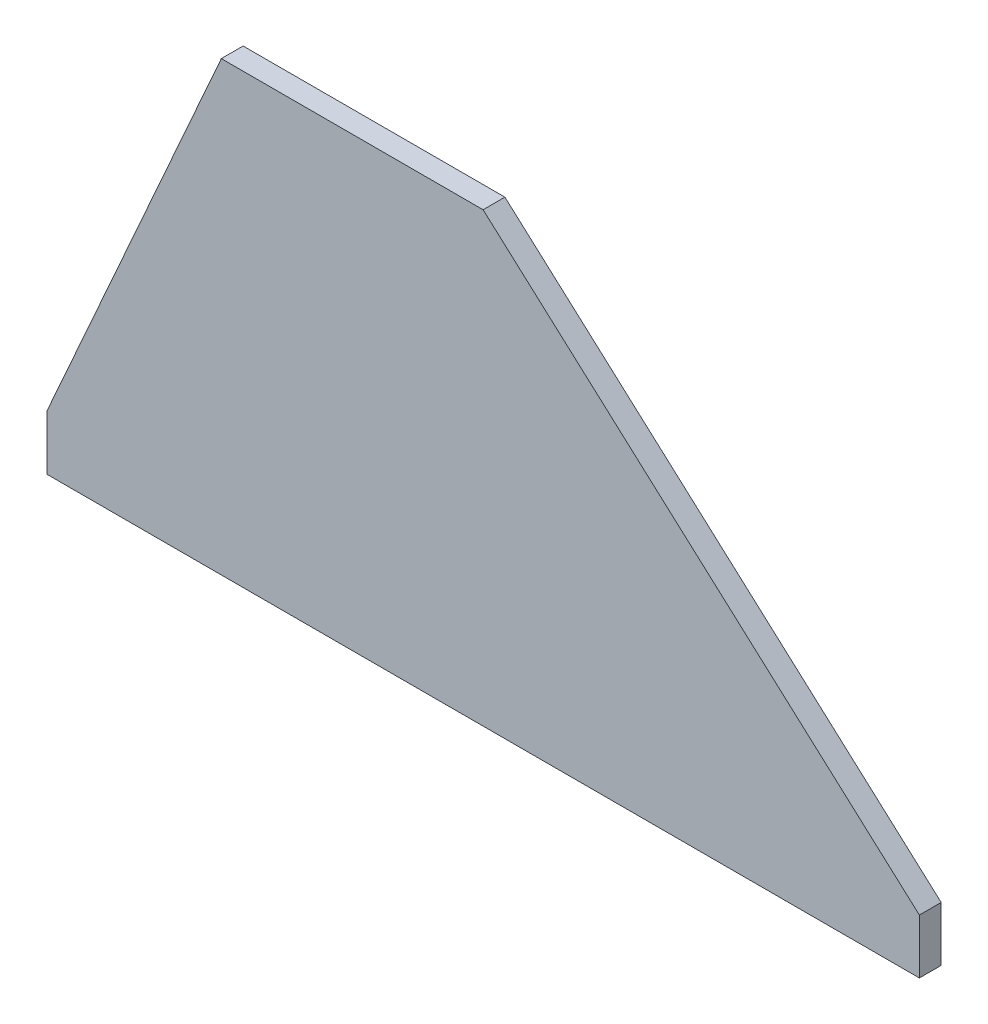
ISO-10303-21;
HEADER;
FILE_DESCRIPTION(('STEP AP214'),'2;1');
FILE_NAME('part.step','',(''),(''),'','','');
FILE_SCHEMA(('AUTOMOTIVE_DESIGN { 1 0 10303 214 1 1 1 1 }'));
ENDSEC;
DATA;
#1=APPLICATION_CONTEXT('core data for automotive mechanical design processes');
#2=APPLICATION_PROTOCOL_DEFINITION('international standard','automotive_design',2000,#1);
#3=PRODUCT_CONTEXT('',#1,'mechanical');
#4=PRODUCT('Part','Part','',(#3));
#5=PRODUCT_RELATED_PRODUCT_CATEGORY('part','',(#4));
#6=PRODUCT_DEFINITION_FORMATION('','',#4);
#7=PRODUCT_DEFINITION_CONTEXT('part definition',#1,'design');
#8=PRODUCT_DEFINITION('design','',#6,#7);
#9=PRODUCT_DEFINITION_SHAPE('','',#8);
#10=(LENGTH_UNIT() NAMED_UNIT(*) SI_UNIT(.MILLI.,.METRE.));
#11=(NAMED_UNIT(*) PLANE_ANGLE_UNIT() SI_UNIT($,.RADIAN.));
#12=(NAMED_UNIT(*) SI_UNIT($,.STERADIAN.) SOLID_ANGLE_UNIT());
#13=UNCERTAINTY_MEASURE_WITH_UNIT(LENGTH_MEASURE(1.E-05),#10,'distance_accuracy_value','');
#14=(GEOMETRIC_REPRESENTATION_CONTEXT(3) GLOBAL_UNCERTAINTY_ASSIGNED_CONTEXT((#13)) GLOBAL_UNIT_ASSIGNED_CONTEXT((#10,
#11,#12)) REPRESENTATION_CONTEXT('',''));
#15=CARTESIAN_POINT('',(0.,0.,0.));
#16=DIRECTION('',(0.,0.,1.));
#17=DIRECTION('',(1.,0.,0.));
#18=AXIS2_PLACEMENT_3D('',#15,#16,#17);
#19=CARTESIAN_POINT('',(0.,0.,3.175));
#20=DIRECTION('',(1.,0.,0.));
#21=DIRECTION('',(0.,1.,0.));
#22=AXIS2_PLACEMENT_3D('',#19,#20,#21);
#23=PLANE('',#22);
#24=DIRECTION('',(0.,-1.,0.));
#25=VECTOR('',#24,1.);
#26=CARTESIAN_POINT('',(0.,0.,0.));
#27=LINE('',#26,#25);
#28=CARTESIAN_POINT('',(0.,0.,0.));
#29=VERTEX_POINT('',#28);
#30=CARTESIAN_POINT('',(0.,-7.9375,0.));
#31=VERTEX_POINT('',#30);
#32=EDGE_CURVE('E87',#29,#31,#27,.T.);
#33=ORIENTED_EDGE('',*,*,#32,.T.);
#34=DIRECTION('',(0.,0.,-1.));
#35=VECTOR('',#34,1.);
#36=CARTESIAN_POINT('',(0.,-7.9375,3.175));
#37=LINE('',#36,#35);
#38=CARTESIAN_POINT('',(0.,-7.9375,3.175));
#39=VERTEX_POINT('',#38);
#40=EDGE_CURVE('E11',#39,#31,#37,.T.);
#41=ORIENTED_EDGE('',*,*,#40,.F.);
#42=DIRECTION('',(0.,-1.,0.));
#43=VECTOR('',#42,1.);
#44=CARTESIAN_POINT('',(0.,0.,3.175));
#45=LINE('',#44,#43);
#46=CARTESIAN_POINT('',(0.,0.,3.175));
#47=VERTEX_POINT('',#46);
#48=EDGE_CURVE('E110',#47,#39,#45,.T.);
#49=ORIENTED_EDGE('',*,*,#48,.F.);
#50=DIRECTION('',(0.,0.,-1.));
#51=VECTOR('',#50,1.);
#52=CARTESIAN_POINT('',(0.,0.,3.175));
#53=LINE('',#52,#51);
#54=EDGE_CURVE('E100',#47,#29,#53,.T.);
#55=ORIENTED_EDGE('',*,*,#54,.T.);
#56=EDGE_LOOP('',(#33,#41,#49,#55));
#57=FACE_BOUND('',#56,.T.);
#58=ADVANCED_FACE('F31',(#57),#23,.F.);
#59=CARTESIAN_POINT('',(0.,-7.9375,3.175));
#60=DIRECTION('',(0.,1.,0.));
#61=DIRECTION('',(0.,0.,1.));
#62=AXIS2_PLACEMENT_3D('',#59,#60,#61);
#63=PLANE('',#62);
#64=DIRECTION('',(1.,0.,0.));
#65=VECTOR('',#64,1.);
#66=CARTESIAN_POINT('',(0.,-7.9375,0.));
#67=LINE('',#66,#65);
#68=CARTESIAN_POINT('',(127.,-7.9375,0.));
#69=VERTEX_POINT('',#68);
#70=EDGE_CURVE('E83',#31,#69,#67,.T.);
#71=ORIENTED_EDGE('',*,*,#70,.T.);
#72=DIRECTION('',(0.,0.,-1.));
#73=VECTOR('',#72,1.);
#74=CARTESIAN_POINT('',(127.,-7.9375,3.175));
#75=LINE('',#74,#73);
#76=CARTESIAN_POINT('',(127.,-7.9375,3.175));
#77=VERTEX_POINT('',#76);
#78=EDGE_CURVE('E38',#77,#69,#75,.T.);
#79=ORIENTED_EDGE('',*,*,#78,.F.);
#80=DIRECTION('',(1.,0.,0.));
#81=VECTOR('',#80,1.);
#82=CARTESIAN_POINT('',(0.,-7.9375,3.175));
#83=LINE('',#82,#81);
#84=EDGE_CURVE('E96',#39,#77,#83,.T.);
#85=ORIENTED_EDGE('',*,*,#84,.F.);
#86=ORIENTED_EDGE('',*,*,#40,.T.);
#87=EDGE_LOOP('',(#71,#79,#85,#86));
#88=FACE_BOUND('',#87,.T.);
#89=ADVANCED_FACE('F95',(#88),#63,.F.);
#90=CARTESIAN_POINT('',(127.,0.,3.175));
#91=DIRECTION('',(-1.,0.,0.));
#92=DIRECTION('',(0.,0.,1.));
#93=AXIS2_PLACEMENT_3D('',#90,#91,#92);
#94=PLANE('',#93);
#95=DIRECTION('',(0.,1.,0.));
#96=VECTOR('',#95,1.);
#97=CARTESIAN_POINT('',(127.,0.,0.));
#98=LINE('',#97,#96);
#99=CARTESIAN_POINT('',(127.,0.,0.));
#100=VERTEX_POINT('',#99);
#101=EDGE_CURVE('E89',#69,#100,#98,.T.);
#102=ORIENTED_EDGE('',*,*,#101,.T.);
#103=DIRECTION('',(0.,0.,-1.));
#104=VECTOR('',#103,1.);
#105=CARTESIAN_POINT('',(127.,0.,3.175));
#106=LINE('',#105,#104);
#107=CARTESIAN_POINT('',(127.,0.,3.175));
#108=VERTEX_POINT('',#107);
#109=EDGE_CURVE('E126',#108,#100,#106,.T.);
#110=ORIENTED_EDGE('',*,*,#109,.F.);
#111=DIRECTION('',(0.,1.,0.));
#112=VECTOR('',#111,1.);
#113=CARTESIAN_POINT('',(127.,0.,3.175));
#114=LINE('',#113,#112);
#115=EDGE_CURVE('E113',#77,#108,#114,.T.);
#116=ORIENTED_EDGE('',*,*,#115,.F.);
#117=ORIENTED_EDGE('',*,*,#78,.T.);
#118=EDGE_LOOP('',(#102,#110,#116,#117));
#119=FACE_BOUND('',#118,.T.);
#120=ADVANCED_FACE('F130',(#119),#94,.F.);
#121=CARTESIAN_POINT('',(127.,0.,3.175));
#122=DIRECTION('',(-0.66896473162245,-0.743294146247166,0.));
#123=DIRECTION('',(0.743294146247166,-0.66896473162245,0.));
#124=AXIS2_PLACEMENT_3D('',#121,#122,#123);
#125=PLANE('',#124);
#126=DIRECTION('',(-0.743294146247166,0.66896473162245,0.));
#127=VECTOR('',#126,1.);
#128=CARTESIAN_POINT('',(127.,0.,0.));
#129=LINE('',#128,#127);
#130=CARTESIAN_POINT('',(63.5,57.15,0.));
#131=VERTEX_POINT('',#130);
#132=EDGE_CURVE('E104',#100,#131,#129,.T.);
#133=ORIENTED_EDGE('',*,*,#132,.T.);
#134=DIRECTION('',(0.,0.,-1.));
#135=VECTOR('',#134,1.);
#136=CARTESIAN_POINT('',(63.5,57.15,3.175));
#137=LINE('',#136,#135);
#138=CARTESIAN_POINT('',(63.5,57.15,3.175));
#139=VERTEX_POINT('',#138);
#140=EDGE_CURVE('E123',#139,#131,#137,.T.);
#141=ORIENTED_EDGE('',*,*,#140,.F.);
#142=DIRECTION('',(-0.743294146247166,0.66896473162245,0.));
#143=VECTOR('',#142,1.);
#144=CARTESIAN_POINT('',(127.,0.,3.175));
#145=LINE('',#144,#143);
#146=EDGE_CURVE('E115',#108,#139,#145,.T.);
#147=ORIENTED_EDGE('',*,*,#146,.F.);
#148=ORIENTED_EDGE('',*,*,#109,.T.);
#149=EDGE_LOOP('',(#133,#141,#147,#148));
#150=FACE_BOUND('',#149,.T.);
#151=ADVANCED_FACE('F136',(#150),#125,.F.);
#152=CARTESIAN_POINT('',(63.5,57.15,3.175));
#153=DIRECTION('',(0.,-1.,0.));
#154=DIRECTION('',(1.,0.,0.));
#155=AXIS2_PLACEMENT_3D('',#152,#153,#154);
#156=PLANE('',#155);
#157=DIRECTION('',(-1.,0.,0.));
#158=VECTOR('',#157,1.);
#159=CARTESIAN_POINT('',(63.5,57.15,0.));
#160=LINE('',#159,#158);
#161=CARTESIAN_POINT('',(25.4,57.15,0.));
#162=VERTEX_POINT('',#161);
#163=EDGE_CURVE('E106',#131,#162,#160,.T.);
#164=ORIENTED_EDGE('',*,*,#163,.T.);
#165=DIRECTION('',(0.,0.,-1.));
#166=VECTOR('',#165,1.);
#167=CARTESIAN_POINT('',(25.4,57.15,3.175));
#168=LINE('',#167,#166);
#169=CARTESIAN_POINT('',(25.4,57.15,3.175));
#170=VERTEX_POINT('',#169);
#171=EDGE_CURVE('E120',#170,#162,#168,.T.);
#172=ORIENTED_EDGE('',*,*,#171,.F.);
#173=DIRECTION('',(-1.,0.,0.));
#174=VECTOR('',#173,1.);
#175=CARTESIAN_POINT('',(63.5,57.15,3.175));
#176=LINE('',#175,#174);
#177=EDGE_CURVE('E50',#139,#170,#176,.T.);
#178=ORIENTED_EDGE('',*,*,#177,.F.);
#179=ORIENTED_EDGE('',*,*,#140,.T.);
#180=EDGE_LOOP('',(#164,#172,#178,#179));
#181=FACE_BOUND('',#180,.T.);
#182=ADVANCED_FACE('F139',(#181),#156,.F.);
#183=CARTESIAN_POINT('',(25.4,57.15,3.175));
#184=DIRECTION('',(0.913811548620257,-0.406138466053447,0.));
#185=DIRECTION('',(0.406138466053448,0.913811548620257,0.));
#186=AXIS2_PLACEMENT_3D('',#183,#184,#185);
#187=PLANE('',#186);
#188=DIRECTION('',(-0.406138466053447,-0.913811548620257,0.));
#189=VECTOR('',#188,1.);
#190=CARTESIAN_POINT('',(25.4,57.15,0.));
#191=LINE('',#190,#189);
#192=EDGE_CURVE('E108',#162,#29,#191,.T.);
#193=ORIENTED_EDGE('',*,*,#192,.T.);
#194=ORIENTED_EDGE('',*,*,#54,.F.);
#195=DIRECTION('',(-0.406138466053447,-0.913811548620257,0.));
#196=VECTOR('',#195,1.);
#197=CARTESIAN_POINT('',(25.4,57.15,3.175));
#198=LINE('',#197,#196);
#199=EDGE_CURVE('E45',#170,#47,#198,.T.);
#200=ORIENTED_EDGE('',*,*,#199,.F.);
#201=ORIENTED_EDGE('',*,*,#171,.T.);
#202=EDGE_LOOP('',(#193,#194,#200,#201));
#203=FACE_BOUND('',#202,.T.);
#204=ADVANCED_FACE('F141',(#203),#187,.F.);
#205=CARTESIAN_POINT('',(0.,57.15,3.175));
#206=DIRECTION('',(0.,0.,-1.));
#207=DIRECTION('',(-1.,0.,0.));
#208=AXIS2_PLACEMENT_3D('',#205,#206,#207);
#209=PLANE('',#208);
#210=ORIENTED_EDGE('',*,*,#48,.T.);
#211=ORIENTED_EDGE('',*,*,#84,.T.);
#212=ORIENTED_EDGE('',*,*,#115,.T.);
#213=ORIENTED_EDGE('',*,*,#146,.T.);
#214=ORIENTED_EDGE('',*,*,#177,.T.);
#215=ORIENTED_EDGE('',*,*,#199,.T.);
#216=EDGE_LOOP('',(#210,#211,#212,#213,#214,#215));
#217=FACE_BOUND('',#216,.T.);
#218=ADVANCED_FACE('F133',(#217),#209,.F.);
#219=CARTESIAN_POINT('',(0.,57.15,0.));
#220=DIRECTION('',(0.,0.,-1.));
#221=DIRECTION('',(-1.,0.,0.));
#222=AXIS2_PLACEMENT_3D('',#219,#220,#221);
#223=PLANE('',#222);
#224=ORIENTED_EDGE('',*,*,#32,.F.);
#225=ORIENTED_EDGE('',*,*,#192,.F.);
#226=ORIENTED_EDGE('',*,*,#163,.F.);
#227=ORIENTED_EDGE('',*,*,#132,.F.);
#228=ORIENTED_EDGE('',*,*,#101,.F.);
#229=ORIENTED_EDGE('',*,*,#70,.F.);
#230=EDGE_LOOP('',(#224,#225,#226,#227,#228,#229));
#231=FACE_BOUND('',#230,.T.);
#232=ADVANCED_FACE('F84',(#231),#223,.T.);
#233=CLOSED_SHELL('',(#58,#89,#120,#151,#182,#204,#218,#232));
#234=MANIFOLD_SOLID_BREP('B2',#233);
#235=ADVANCED_BREP_SHAPE_REPRESENTATION('',(#18,#234),#14);
#236=SHAPE_DEFINITION_REPRESENTATION(#9,#235);
ENDSEC;
END-ISO-10303-21;
